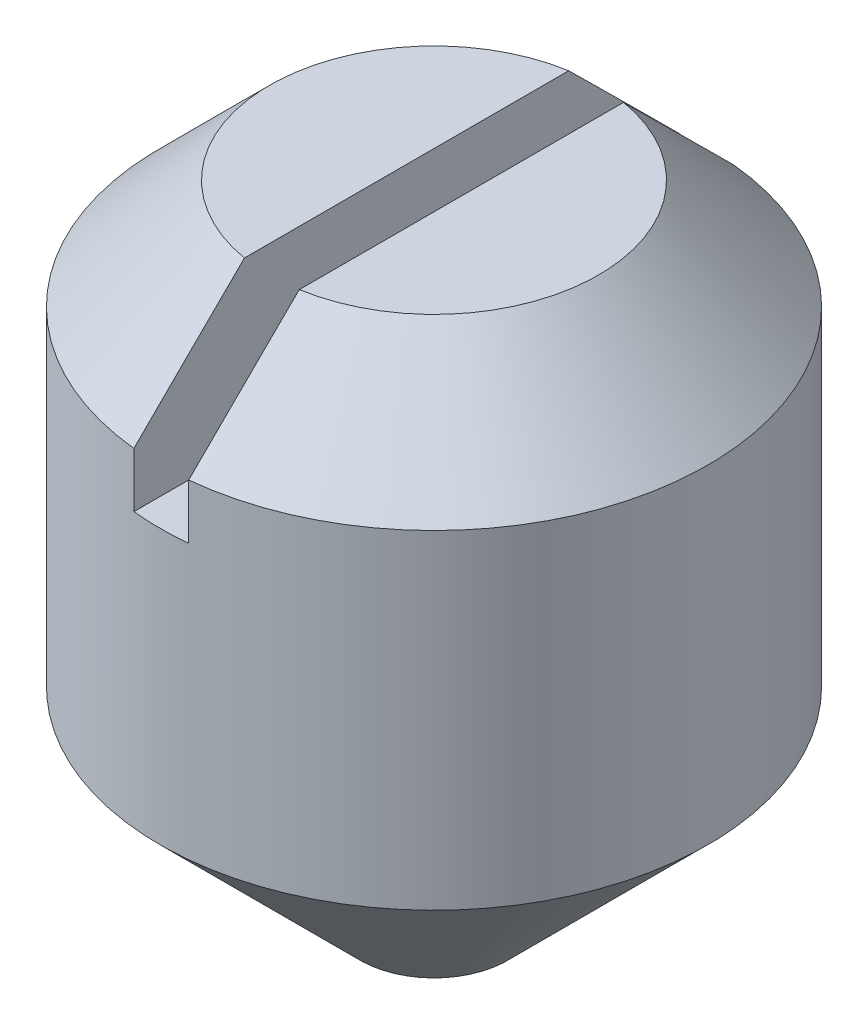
from build123d import *

# Parameters (mm, degrees)
SKETCH_1_R               = 2.5
EXTRUDE_1_DEPTH          = 4
EXTRUDE_2_DEPTH          = 3
EXTRUDE_2_DEPTH_BACK     = 3
SKETCH_2_R               = 1.8
CHAMFER_1_SIZE           = 1
FILLET_2_R               = 1.2
SKETCH_3_W               = 0.5
SKETCH_3_H               = 6.260432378
CUT_EXTRUDE_1_DEPTH      = 1.5
SKETCH_7_W               = 6.132266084
SKETCH_7_H               = 3.705744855
CUT_EXTRUDE_3_DEPTH      = 10
CUT_EXTRUDE_4_DEPTH      = 2
CUT_EXTRUDE_4_DEPTH_BACK = 6.338539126
SKETCH_9_W               = 7.219038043
SKETCH_9_H               = 1.176135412


with BuildPart() as part:
    # Sketch 1 → Extrude 1 (new body)
    with BuildSketch(Plane(origin=(0, 0, 0), x_dir=(1, 0, 0), z_dir=(0, 1, 0))):
        with Locations(Location((0, 0, 0), (0, 0, 270))):
            Circle(SKETCH_1_R)
    extrude(amount=EXTRUDE_1_DEPTH)

    # Sketch 2 → Extrude 2 (add, two sides: drawn at the far end of the back side and taken through both)
    with BuildSketch(Plane(origin=(0, 0, 0), x_dir=(1, 0, 0), z_dir=(0, 1, 0)).offset(-EXTRUDE_2_DEPTH_BACK)):
        with Locations(Location((0, 0, 0), (0, 0, 270))):
            Circle(SKETCH_2_R)
    extrude(amount=EXTRUDE_2_DEPTH + EXTRUDE_2_DEPTH_BACK)

    # Chamfer 1
    chamfer_1_edges = [part.edges().sort_by_distance(p)[0] for p in [
        (0, 4, -2.5),
    ]]
    chamfer(chamfer_1_edges, length=CHAMFER_1_SIZE)

    # Fillet 2
    fillet_2_edges = [part.edges().sort_by_distance(p)[0] for p in [
        (0, -3, -1.8),
    ]]
    fillet(fillet_2_edges, radius=FILLET_2_R)

    # Sketch 3 → Cut-Extrude 1 (cut)
    with BuildSketch(Plane(origin=(0, 4, 0), x_dir=(-1, 0, 0), z_dir=(0, 1, 0))):
        with Locations((0, 0.011060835)):
            Rectangle(SKETCH_3_W, SKETCH_3_H)
    extrude(amount=-CUT_EXTRUDE_1_DEPTH, mode=Mode.SUBTRACT)

    # Sketch 7 → Cut-Extrude 3 (cut, symmetric)
    with BuildSketch(Plane.XY):
        with Locations((-0.410534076, -1.852872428)):
            Rectangle(SKETCH_7_W, SKETCH_7_H)
    extrude(amount=CUT_EXTRUDE_3_DEPTH, both=True, mode=Mode.SUBTRACT)

    # Sketch 8 → Revolve 1 (revolve)
    with BuildSketch(Plane.XY, mode=Mode.PRIVATE) as revolve_1_sk:
        Polygon((-2.5, 0), (0, 0), (0, -2.5), align=None)
    revolve(revolve_1_sk.sketch.rotate(Axis((0, 0, 0), (0, -1, 0)), 95.739170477), axis=Axis((0, 0, 0), (0, -1, 0)))

    # Sketch 9 → Cut-Extrude 4 (cut, two sides: drawn at the far end of the back side and taken through both)
    with BuildSketch(Plane.XY.offset(-CUT_EXTRUDE_4_DEPTH_BACK)):
        with Locations((0.466398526, -2.414278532)):
            Rectangle(SKETCH_9_W, SKETCH_9_H)
    extrude(amount=CUT_EXTRUDE_4_DEPTH + CUT_EXTRUDE_4_DEPTH_BACK, mode=Mode.SUBTRACT)


solid = part.part
